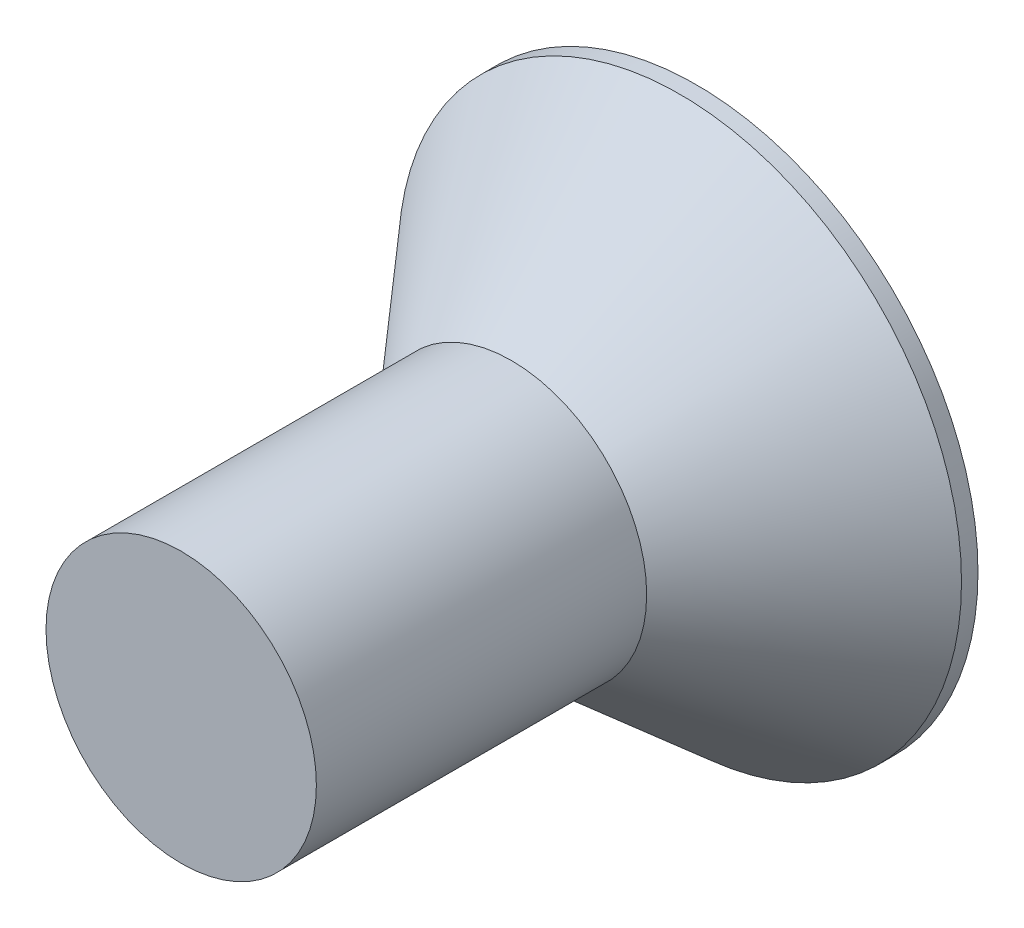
ISO-10303-21;
HEADER;
FILE_DESCRIPTION(('STEP AP214'),'2;1');
FILE_NAME('part.step','',(''),(''),'','','');
FILE_SCHEMA(('AUTOMOTIVE_DESIGN { 1 0 10303 214 1 1 1 1 }'));
ENDSEC;
DATA;
#1=APPLICATION_CONTEXT('core data for automotive mechanical design processes');
#2=APPLICATION_PROTOCOL_DEFINITION('international standard','automotive_design',2000,#1);
#3=PRODUCT_CONTEXT('',#1,'mechanical');
#4=PRODUCT('Part','Part','',(#3));
#5=PRODUCT_RELATED_PRODUCT_CATEGORY('part','',(#4));
#6=PRODUCT_DEFINITION_FORMATION('','',#4);
#7=PRODUCT_DEFINITION_CONTEXT('part definition',#1,'design');
#8=PRODUCT_DEFINITION('design','',#6,#7);
#9=PRODUCT_DEFINITION_SHAPE('','',#8);
#10=(LENGTH_UNIT() NAMED_UNIT(*) SI_UNIT(.MILLI.,.METRE.));
#11=(NAMED_UNIT(*) PLANE_ANGLE_UNIT() SI_UNIT($,.RADIAN.));
#12=(NAMED_UNIT(*) SI_UNIT($,.STERADIAN.) SOLID_ANGLE_UNIT());
#13=UNCERTAINTY_MEASURE_WITH_UNIT(LENGTH_MEASURE(1.E-05),#10,'distance_accuracy_value','');
#14=(GEOMETRIC_REPRESENTATION_CONTEXT(3) GLOBAL_UNCERTAINTY_ASSIGNED_CONTEXT((#13)) GLOBAL_UNIT_ASSIGNED_CONTEXT((#10,
#11,#12)) REPRESENTATION_CONTEXT('',''));
#15=CARTESIAN_POINT('',(0.,0.,0.));
#16=DIRECTION('',(0.,0.,1.));
#17=DIRECTION('',(1.,0.,0.));
#18=AXIS2_PLACEMENT_3D('',#15,#16,#17);
#19=CARTESIAN_POINT('',(0.,0.,7.9375));
#20=DIRECTION('',(0.,0.,1.));
#21=DIRECTION('',(1.,0.,0.));
#22=AXIS2_PLACEMENT_3D('',#19,#20,#21);
#23=PLANE('',#22);
#24=CARTESIAN_POINT('',(0.,0.,7.9375));
#25=DIRECTION('',(0.,0.,1.));
#26=DIRECTION('',(1.,0.,0.));
#27=AXIS2_PLACEMENT_3D('',#24,#25,#26);
#28=CIRCLE('',#27,2.0828);
#29=CARTESIAN_POINT('',(2.0828,0.,7.9375));
#30=VERTEX_POINT('',#29);
#31=EDGE_CURVE('E11',#30,#30,#28,.T.);
#32=ORIENTED_EDGE('',*,*,#31,.T.);
#33=EDGE_LOOP('',(#32));
#34=FACE_BOUND('',#33,.T.);
#35=ADVANCED_FACE('F33',(#34),#23,.T.);
#36=CARTESIAN_POINT('',(0.,0.,7.9375));
#37=DIRECTION('',(0.,0.,1.));
#38=DIRECTION('',(1.,0.,0.));
#39=AXIS2_PLACEMENT_3D('',#36,#37,#38);
#40=CYLINDRICAL_SURFACE('',#39,2.0828);
#41=CARTESIAN_POINT('',(0.,0.,2.84888736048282));
#42=DIRECTION('',(0.,0.,1.));
#43=DIRECTION('',(1.,0.,0.));
#44=AXIS2_PLACEMENT_3D('',#41,#42,#43);
#45=CIRCLE('',#44,2.0828);
#46=CARTESIAN_POINT('',(2.0828,0.,2.84888736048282));
#47=VERTEX_POINT('',#46);
#48=EDGE_CURVE('E40',#47,#47,#45,.T.);
#49=ORIENTED_EDGE('',*,*,#48,.T.);
#50=EDGE_LOOP('',(#49));
#51=FACE_BOUND('',#50,.T.);
#52=ORIENTED_EDGE('',*,*,#31,.F.);
#53=EDGE_LOOP('',(#52));
#54=FACE_BOUND('',#53,.T.);
#55=ADVANCED_FACE('F147',(#51,#54),#40,.T.);
#56=CARTESIAN_POINT('',(0.,0.,2.84888736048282));
#57=DIRECTION('',(0.,0.,-1.));
#58=DIRECTION('',(-1.,0.,0.));
#59=AXIS2_PLACEMENT_3D('',#56,#57,#58);
#60=CONICAL_SURFACE('',#59,2.0828,0.715584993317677);
#61=CARTESIAN_POINT('',(0.,0.,0.254));
#62=DIRECTION('',(0.,0.,1.));
#63=DIRECTION('',(1.,0.,0.));
#64=AXIS2_PLACEMENT_3D('',#61,#62,#63);
#65=CIRCLE('',#64,4.33850116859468);
#66=CARTESIAN_POINT('',(4.33850116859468,0.,0.254));
#67=VERTEX_POINT('',#66);
#68=EDGE_CURVE('E142',#67,#67,#65,.T.);
#69=ORIENTED_EDGE('',*,*,#68,.T.);
#70=EDGE_LOOP('',(#69));
#71=FACE_BOUND('',#70,.T.);
#72=ORIENTED_EDGE('',*,*,#48,.F.);
#73=EDGE_LOOP('',(#72));
#74=FACE_BOUND('',#73,.T.);
#75=ADVANCED_FACE('F150',(#71,#74),#60,.T.);
#76=CARTESIAN_POINT('',(0.,0.,7.9375));
#77=DIRECTION('',(0.,0.,1.));
#78=DIRECTION('',(1.,0.,0.));
#79=AXIS2_PLACEMENT_3D('',#76,#77,#78);
#80=CYLINDRICAL_SURFACE('',#79,4.33850116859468);
#81=CARTESIAN_POINT('',(0.,0.,0.));
#82=DIRECTION('',(0.,0.,1.));
#83=DIRECTION('',(1.,0.,0.));
#84=AXIS2_PLACEMENT_3D('',#81,#82,#83);
#85=CIRCLE('',#84,4.33850116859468);
#86=CARTESIAN_POINT('',(4.33850116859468,0.,0.));
#87=VERTEX_POINT('',#86);
#88=EDGE_CURVE('E134',#87,#87,#85,.T.);
#89=ORIENTED_EDGE('',*,*,#88,.T.);
#90=EDGE_LOOP('',(#89));
#91=FACE_BOUND('',#90,.T.);
#92=ORIENTED_EDGE('',*,*,#68,.F.);
#93=EDGE_LOOP('',(#92));
#94=FACE_BOUND('',#93,.T.);
#95=ADVANCED_FACE('F152',(#91,#94),#80,.T.);
#96=CARTESIAN_POINT('',(0.,-4.33850116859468,0.));
#97=DIRECTION('',(0.,0.,-1.));
#98=DIRECTION('',(-1.,0.,0.));
#99=AXIS2_PLACEMENT_3D('',#96,#97,#98);
#100=PLANE('',#99);
#101=DIRECTION('',(0.866025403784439,-0.5,0.));
#102=VECTOR('',#101,1.);
#103=CARTESIAN_POINT('',(0.,1.36381680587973,0.));
#104=LINE('',#103,#102);
#105=CARTESIAN_POINT('',(0.,1.36381680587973,0.));
#106=VERTEX_POINT('',#105);
#107=CARTESIAN_POINT('',(1.1811,0.681908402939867,0.));
#108=VERTEX_POINT('',#107);
#109=EDGE_CURVE('E47',#106,#108,#104,.T.);
#110=ORIENTED_EDGE('',*,*,#109,.F.);
#111=DIRECTION('',(0.866025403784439,0.5,0.));
#112=VECTOR('',#111,1.);
#113=CARTESIAN_POINT('',(-1.1811,0.681908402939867,0.));
#114=LINE('',#113,#112);
#115=CARTESIAN_POINT('',(-1.1811,0.681908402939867,0.));
#116=VERTEX_POINT('',#115);
#117=EDGE_CURVE('E130',#116,#106,#114,.T.);
#118=ORIENTED_EDGE('',*,*,#117,.F.);
#119=DIRECTION('',(0.,1.,0.));
#120=VECTOR('',#119,1.);
#121=CARTESIAN_POINT('',(-1.1811,-0.681908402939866,0.));
#122=LINE('',#121,#120);
#123=CARTESIAN_POINT('',(-1.1811,-0.681908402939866,0.));
#124=VERTEX_POINT('',#123);
#125=EDGE_CURVE('E128',#124,#116,#122,.T.);
#126=ORIENTED_EDGE('',*,*,#125,.F.);
#127=DIRECTION('',(-0.866025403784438,0.5,0.));
#128=VECTOR('',#127,1.);
#129=CARTESIAN_POINT('',(0.,-1.36381680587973,0.));
#130=LINE('',#129,#128);
#131=CARTESIAN_POINT('',(0.,-1.36381680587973,0.));
#132=VERTEX_POINT('',#131);
#133=EDGE_CURVE('E95',#132,#124,#130,.T.);
#134=ORIENTED_EDGE('',*,*,#133,.F.);
#135=DIRECTION('',(-0.866025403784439,-0.5,0.));
#136=VECTOR('',#135,1.);
#137=CARTESIAN_POINT('',(1.1811,-0.681908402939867,0.));
#138=LINE('',#137,#136);
#139=CARTESIAN_POINT('',(1.1811,-0.681908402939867,0.));
#140=VERTEX_POINT('',#139);
#141=EDGE_CURVE('E124',#140,#132,#138,.T.);
#142=ORIENTED_EDGE('',*,*,#141,.F.);
#143=DIRECTION('',(0.,-1.,0.));
#144=VECTOR('',#143,1.);
#145=CARTESIAN_POINT('',(1.1811,0.681908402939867,0.));
#146=LINE('',#145,#144);
#147=EDGE_CURVE('E121',#108,#140,#146,.T.);
#148=ORIENTED_EDGE('',*,*,#147,.F.);
#149=EDGE_LOOP('',(#110,#118,#126,#134,#142,#148));
#150=FACE_BOUND('',#149,.T.);
#151=ORIENTED_EDGE('',*,*,#88,.F.);
#152=EDGE_LOOP('',(#151));
#153=FACE_BOUND('',#152,.T.);
#154=ADVANCED_FACE('F159',(#150,#153),#100,.T.);
#155=CARTESIAN_POINT('',(0.,1.36381680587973,2.794));
#156=DIRECTION('',(0.5,0.866025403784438,0.));
#157=DIRECTION('',(-0.866025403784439,0.5,0.));
#158=AXIS2_PLACEMENT_3D('',#155,#156,#157);
#159=PLANE('',#158);
#160=ORIENTED_EDGE('',*,*,#109,.T.);
#161=DIRECTION('',(0.,0.,-1.));
#162=VECTOR('',#161,1.);
#163=CARTESIAN_POINT('',(1.1811,0.681908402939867,2.794));
#164=LINE('',#163,#162);
#165=CARTESIAN_POINT('',(1.1811,0.681908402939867,2.794));
#166=VERTEX_POINT('',#165);
#167=EDGE_CURVE('E77',#166,#108,#164,.T.);
#168=ORIENTED_EDGE('',*,*,#167,.F.);
#169=DIRECTION('',(0.866025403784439,-0.5,0.));
#170=VECTOR('',#169,1.);
#171=CARTESIAN_POINT('',(0.,1.36381680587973,2.794));
#172=LINE('',#171,#170);
#173=CARTESIAN_POINT('',(0.,1.36381680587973,2.794));
#174=VERTEX_POINT('',#173);
#175=EDGE_CURVE('E132',#174,#166,#172,.T.);
#176=ORIENTED_EDGE('',*,*,#175,.F.);
#177=DIRECTION('',(0.,0.,-1.));
#178=VECTOR('',#177,1.);
#179=CARTESIAN_POINT('',(0.,1.36381680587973,2.794));
#180=LINE('',#179,#178);
#181=EDGE_CURVE('E55',#174,#106,#180,.T.);
#182=ORIENTED_EDGE('',*,*,#181,.T.);
#183=EDGE_LOOP('',(#160,#168,#176,#182));
#184=FACE_BOUND('',#183,.T.);
#185=ADVANCED_FACE('F190',(#184),#159,.F.);
#186=CARTESIAN_POINT('',(-1.1811,0.681908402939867,2.794));
#187=DIRECTION('',(-0.5,0.866025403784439,0.));
#188=DIRECTION('',(-0.866025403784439,-0.5,0.));
#189=AXIS2_PLACEMENT_3D('',#186,#187,#188);
#190=PLANE('',#189);
#191=ORIENTED_EDGE('',*,*,#117,.T.);
#192=ORIENTED_EDGE('',*,*,#181,.F.);
#193=DIRECTION('',(0.866025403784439,0.5,0.));
#194=VECTOR('',#193,1.);
#195=CARTESIAN_POINT('',(-1.1811,0.681908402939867,2.794));
#196=LINE('',#195,#194);
#197=CARTESIAN_POINT('',(-1.1811,0.681908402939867,2.794));
#198=VERTEX_POINT('',#197);
#199=EDGE_CURVE('E107',#198,#174,#196,.T.);
#200=ORIENTED_EDGE('',*,*,#199,.F.);
#201=DIRECTION('',(0.,0.,-1.));
#202=VECTOR('',#201,1.);
#203=CARTESIAN_POINT('',(-1.1811,0.681908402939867,2.794));
#204=LINE('',#203,#202);
#205=EDGE_CURVE('E99',#198,#116,#204,.T.);
#206=ORIENTED_EDGE('',*,*,#205,.T.);
#207=EDGE_LOOP('',(#191,#192,#200,#206));
#208=FACE_BOUND('',#207,.T.);
#209=ADVANCED_FACE('F200',(#208),#190,.F.);
#210=CARTESIAN_POINT('',(-1.1811,-0.681908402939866,2.794));
#211=DIRECTION('',(-1.,0.,0.));
#212=DIRECTION('',(0.,-1.,0.));
#213=AXIS2_PLACEMENT_3D('',#210,#211,#212);
#214=PLANE('',#213);
#215=ORIENTED_EDGE('',*,*,#125,.T.);
#216=ORIENTED_EDGE('',*,*,#205,.F.);
#217=DIRECTION('',(0.,1.,0.));
#218=VECTOR('',#217,1.);
#219=CARTESIAN_POINT('',(-1.1811,-0.681908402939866,2.794));
#220=LINE('',#219,#218);
#221=CARTESIAN_POINT('',(-1.1811,-0.681908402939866,2.794));
#222=VERTEX_POINT('',#221);
#223=EDGE_CURVE('E103',#222,#198,#220,.T.);
#224=ORIENTED_EDGE('',*,*,#223,.F.);
#225=DIRECTION('',(0.,0.,-1.));
#226=VECTOR('',#225,1.);
#227=CARTESIAN_POINT('',(-1.1811,-0.681908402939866,2.794));
#228=LINE('',#227,#226);
#229=EDGE_CURVE('E88',#222,#124,#228,.T.);
#230=ORIENTED_EDGE('',*,*,#229,.T.);
#231=EDGE_LOOP('',(#215,#216,#224,#230));
#232=FACE_BOUND('',#231,.T.);
#233=ADVANCED_FACE('F104',(#232),#214,.F.);
#234=CARTESIAN_POINT('',(0.,-1.36381680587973,2.794));
#235=DIRECTION('',(-0.5,-0.866025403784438,0.));
#236=DIRECTION('',(0.866025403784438,-0.5,0.));
#237=AXIS2_PLACEMENT_3D('',#234,#235,#236);
#238=PLANE('',#237);
#239=ORIENTED_EDGE('',*,*,#133,.T.);
#240=ORIENTED_EDGE('',*,*,#229,.F.);
#241=DIRECTION('',(-0.866025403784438,0.5,0.));
#242=VECTOR('',#241,1.);
#243=CARTESIAN_POINT('',(0.,-1.36381680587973,2.794));
#244=LINE('',#243,#242);
#245=CARTESIAN_POINT('',(0.,-1.36381680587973,2.794));
#246=VERTEX_POINT('',#245);
#247=EDGE_CURVE('E92',#246,#222,#244,.T.);
#248=ORIENTED_EDGE('',*,*,#247,.F.);
#249=DIRECTION('',(0.,0.,-1.));
#250=VECTOR('',#249,1.);
#251=CARTESIAN_POINT('',(0.,-1.36381680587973,2.794));
#252=LINE('',#251,#250);
#253=EDGE_CURVE('E100',#246,#132,#252,.T.);
#254=ORIENTED_EDGE('',*,*,#253,.T.);
#255=EDGE_LOOP('',(#239,#240,#248,#254));
#256=FACE_BOUND('',#255,.T.);
#257=ADVANCED_FACE('F90',(#256),#238,.F.);
#258=CARTESIAN_POINT('',(1.1811,-0.681908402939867,2.794));
#259=DIRECTION('',(0.5,-0.866025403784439,0.));
#260=DIRECTION('',(0.866025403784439,0.5,0.));
#261=AXIS2_PLACEMENT_3D('',#258,#259,#260);
#262=PLANE('',#261);
#263=ORIENTED_EDGE('',*,*,#141,.T.);
#264=ORIENTED_EDGE('',*,*,#253,.F.);
#265=DIRECTION('',(-0.866025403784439,-0.5,0.));
#266=VECTOR('',#265,1.);
#267=CARTESIAN_POINT('',(1.1811,-0.681908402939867,2.794));
#268=LINE('',#267,#266);
#269=CARTESIAN_POINT('',(1.1811,-0.681908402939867,2.794));
#270=VERTEX_POINT('',#269);
#271=EDGE_CURVE('E113',#270,#246,#268,.T.);
#272=ORIENTED_EDGE('',*,*,#271,.F.);
#273=DIRECTION('',(0.,0.,-1.));
#274=VECTOR('',#273,1.);
#275=CARTESIAN_POINT('',(1.1811,-0.681908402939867,2.794));
#276=LINE('',#275,#274);
#277=EDGE_CURVE('E137',#270,#140,#276,.T.);
#278=ORIENTED_EDGE('',*,*,#277,.T.);
#279=EDGE_LOOP('',(#263,#264,#272,#278));
#280=FACE_BOUND('',#279,.T.);
#281=ADVANCED_FACE('F225',(#280),#262,.F.);
#282=CARTESIAN_POINT('',(1.1811,0.681908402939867,2.794));
#283=DIRECTION('',(1.,0.,0.));
#284=DIRECTION('',(0.,0.,-1.));
#285=AXIS2_PLACEMENT_3D('',#282,#283,#284);
#286=PLANE('',#285);
#287=ORIENTED_EDGE('',*,*,#147,.T.);
#288=ORIENTED_EDGE('',*,*,#277,.F.);
#289=DIRECTION('',(0.,-1.,0.));
#290=VECTOR('',#289,1.);
#291=CARTESIAN_POINT('',(1.1811,0.681908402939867,2.794));
#292=LINE('',#291,#290);
#293=EDGE_CURVE('E115',#166,#270,#292,.T.);
#294=ORIENTED_EDGE('',*,*,#293,.F.);
#295=ORIENTED_EDGE('',*,*,#167,.T.);
#296=EDGE_LOOP('',(#287,#288,#294,#295));
#297=FACE_BOUND('',#296,.T.);
#298=ADVANCED_FACE('F234',(#297),#286,.F.);
#299=CARTESIAN_POINT('',(2.3622,0.,2.794));
#300=DIRECTION('',(0.,0.,-1.));
#301=DIRECTION('',(-1.,0.,0.));
#302=AXIS2_PLACEMENT_3D('',#299,#300,#301);
#303=PLANE('',#302);
#304=ORIENTED_EDGE('',*,*,#175,.T.);
#305=ORIENTED_EDGE('',*,*,#293,.T.);
#306=ORIENTED_EDGE('',*,*,#271,.T.);
#307=ORIENTED_EDGE('',*,*,#247,.T.);
#308=ORIENTED_EDGE('',*,*,#223,.T.);
#309=ORIENTED_EDGE('',*,*,#199,.T.);
#310=EDGE_LOOP('',(#304,#305,#306,#307,#308,#309));
#311=FACE_BOUND('',#310,.T.);
#312=ADVANCED_FACE('F110',(#311),#303,.T.);
#313=CLOSED_SHELL('',(#35,#55,#75,#95,#154,#185,#209,#233,#257,#281,#298,#312));
#314=MANIFOLD_SOLID_BREP('B2',#313);
#315=ADVANCED_BREP_SHAPE_REPRESENTATION('',(#18,#314),#14);
#316=SHAPE_DEFINITION_REPRESENTATION(#9,#315);
ENDSEC;
END-ISO-10303-21;
